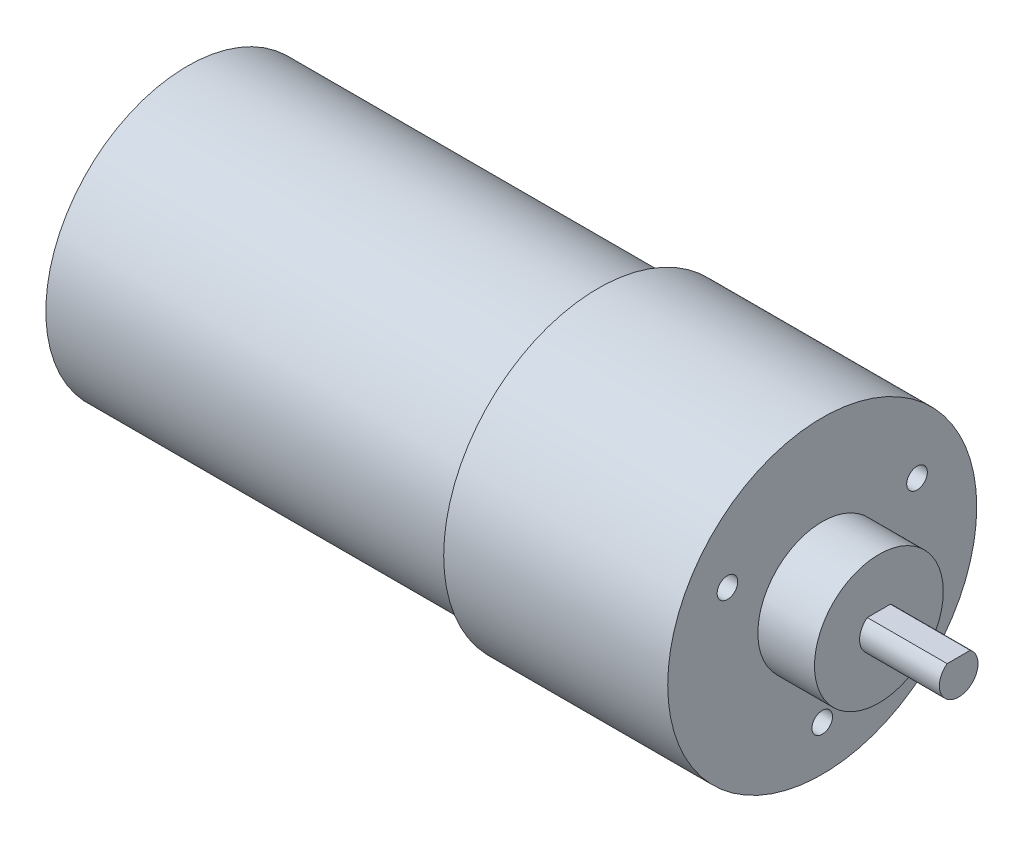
from build123d import *

# Parameters (mm, degrees)
SKETCH1_R      = 11
EXTRUDE1_DEPTH = 31.9
SKETCH2_R      = 12
EXTRUDE2_DEPTH = 17.4
SKETCH3_R      = 5
EXTRUDE3_DEPTH = 4.4
EXTRUDE4_DEPTH = 6.2
SKETCH5_R      = 0.8
EXTRUDE5_DEPTH = 1.5


with BuildPart() as part:
    # Sketch1 → Extrude1 (new body)
    with BuildSketch(Plane(origin=(0, 0, 0), x_dir=(0, 0, -1), z_dir=(1, 0, 0))):
        Circle(SKETCH1_R)
    extrude(amount=EXTRUDE1_DEPTH)

    # Sketch2 → Extrude2 (add)
    with BuildSketch(Plane(origin=(31.9, 0, 0), x_dir=(0, 0, -1), z_dir=(1, 0, 0))):
        Circle(SKETCH2_R)
    extrude(amount=EXTRUDE2_DEPTH)

    # Sketch3 → Extrude3 (add)
    with BuildSketch(Plane(origin=(49.3, 0, 0), x_dir=(0, 0, -1), z_dir=(1, 0, 0))):
        Circle(SKETCH3_R)
    extrude(amount=EXTRUDE3_DEPTH)

    # Sketch4 → Extrude4 (add)
    with BuildSketch(Plane(origin=(53.7, 0, 0), x_dir=(0, 0, -1), z_dir=(1, 0, 0))):
        with BuildLine():
            Line((-0.9, 1.2), (0.9, 1.2))
            ThreePointArc((0.9, 1.2), (0, -1.5), (-0.9, 1.2))
        make_face()
    extrude(amount=EXTRUDE4_DEPTH)

    # Sketch5 → Extrude5 (cut)
    with BuildSketch(Plane(origin=(49.3, 0, 0), x_dir=(0, 0, -1), z_dir=(1, 0, 0))):
        with Locations((0, -8.5)):
            Circle(SKETCH5_R)
        with Locations((-7.361215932, 4.25)):
            Circle(SKETCH5_R)
        with Locations((7.361215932, 4.25)):
            Circle(SKETCH5_R)
    extrude(amount=-EXTRUDE5_DEPTH, mode=Mode.SUBTRACT)


solid = part.part
